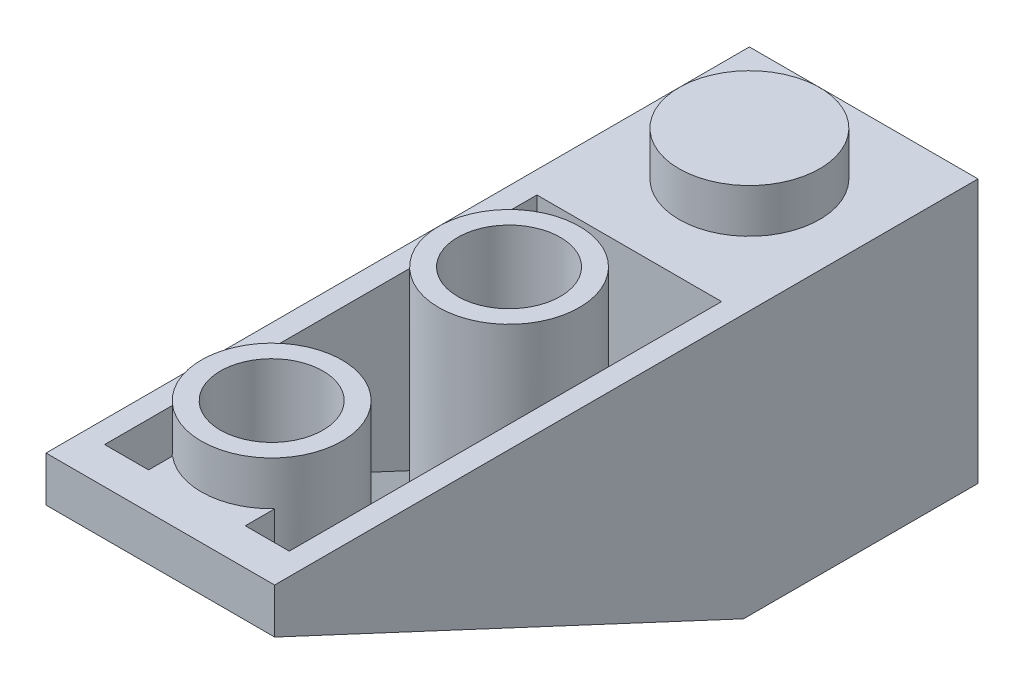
from build123d import *

# Parameters (mm, degrees)
BASE_EXTRUSION_DEPTH    = 7.8
BOSS_EXTRU_1_DEPTH      = 0.75
BOSS_EXTRU_2_DEPTH      = 0.75
ESQUISSE5_W             = 4.9
ESQUISSE5_H             = 5.1
ENL_V_MAT_EXTRU_1_DEPTH = 8
ESQUISSE6_R             = 2.4
BOSS_EXTRU_6_DEPTH      = 1.5
BOSS_EXTRU_7_REACH      = 29.333
ESQUISSE7_R             = 2.4
ESQUISSE7_R_2           = 1.75
ESQUISSE8_R             = 2.4
ENL_V_MAT_EXTRU_2_DEPTH = 1.5
BOSS_EXTRU_8_START      = -1.583169
ESQUISSE9_W             = 3.3
ESQUISSE9_H             = 1.840324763
BOSS_EXTRU_8_DEPTH      = 1.583169
BOSS_EXTRU_9_REACH      = 28.793
ESQUISSE10_W            = 6.3
ESQUISSE10_H            = 0.25


with BuildPart() as part:
    # Esquisse1 → Base-Extrusion (new body)
    with BuildSketch(Plane(origin=(0, 0, 0), x_dir=(0, 0, -1), z_dir=(1, 0, 0))):
        Polygon((-8, -9), (-24, -1.53907747), (-24, 0), (-23, 0), (-23, -1.005385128), (-8, -8), (-8, 0), (0, 0), (0, -9), align=None)
    extrude(amount=-BASE_EXTRUSION_DEPTH)

    # Esquisse2 → Boss.-Extru.1 (add)
    with BuildSketch(Plane(origin=(0, 0, 0), x_dir=(0, 0, -1), z_dir=(1, 0, 0))):
        Polygon((-24, -1.53907747), (-8, -9), (0, -9), (0, 0), (-24, 0), align=None)
    extrude(amount=-BOSS_EXTRU_1_DEPTH)

    # Esquisse3 → Boss.-Extru.2 (add)
    with BuildSketch(Plane.ZY.offset(7.8)):
        Polygon((24, -1.53907747), (8, -9), (0, -9), (0, 0), (24, 0), align=None)
    extrude(amount=-BOSS_EXTRU_2_DEPTH)

    # Esquisse5 → Enl_v. mat.-Extru.1 (cut)
    with BuildSketch(Plane.XZ.offset(9)):
        with Locations((-3.9, 4)):
            Rectangle(ESQUISSE5_W, ESQUISSE5_H)
    extrude(amount=-ENL_V_MAT_EXTRU_1_DEPTH, mode=Mode.SUBTRACT)

    # Esquisse6 → Boss.-Extru.6 (add)
    with BuildSketch(Plane(origin=(0, 0, 0), x_dir=(-1, 0, 0), z_dir=(0, 1, 0))):
        with Locations(Location((3.9, 3.9, 0), (0, 0, 90))):
            Circle(ESQUISSE6_R)
    extrude(amount=BOSS_EXTRU_6_DEPTH)

    # Boss.-Extru.7: up to this plane
    boss_extru_7_end = Plane(origin=(-7.8, -8, 8), z_dir=(0, 0.9063077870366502, -0.4226182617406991))
    # Esquisse7 → Boss.-Extru.7 (add, up to the surface)
    with BuildSketch(Plane(origin=(0, 1.5, 0), x_dir=(-1, 0, 0), z_dir=(0, 1, 0)), mode=Mode.PRIVATE) as boss_extru_7_sk1:
        with Locations(Location((3.9, 12.100625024, 0), (0, 0, 90))):
            Circle(ESQUISSE7_R)
        with Locations(Location((3.9, 12.100625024, 0), (0, 0, 90))):
            Circle(ESQUISSE7_R_2, mode=Mode.SUBTRACT)
    boss_extru_7_tool1 = split(extrude(boss_extru_7_sk1.sketch, amount=-BOSS_EXTRU_7_REACH, mode=Mode.PRIVATE), bisect_by=boss_extru_7_end, keep=Keep.BOTH, mode=Mode.PRIVATE)
    add(boss_extru_7_tool1.solids().sort_by_distance((-3.9, 1.5, 9.768507))[0])
    # Esquisse7 → Boss.-Extru.7 (add, up to the surface)
    with BuildSketch(Plane(origin=(0, 1.5, 0), x_dir=(-1, 0, 0), z_dir=(0, 1, 0)), mode=Mode.PRIVATE) as boss_extru_7_sk2:
        with Locations(Location((4, 20.1, 0), (0, 0, 90))):
            Circle(ESQUISSE7_R)
        with Locations(Location((4, 20.1, 0), (0, 0, 90))):
            Circle(ESQUISSE7_R_2, mode=Mode.SUBTRACT)
    boss_extru_7_tool2 = split(extrude(boss_extru_7_sk2.sketch, amount=-BOSS_EXTRU_7_REACH, mode=Mode.PRIVATE), bisect_by=boss_extru_7_end, keep=Keep.BOTH, mode=Mode.PRIVATE)
    add(boss_extru_7_tool2.solids().sort_by_distance((-4, 1.5, 17.767882))[0])

    # Esquisse8 → Enl_v. mat.-Extru.2 (cut)
    with BuildSketch(Plane.XZ.offset(9)):
        with Locations((-3.9, 12)):
            Circle(ESQUISSE8_R)
    extrude(amount=-ENL_V_MAT_EXTRU_2_DEPTH, mode=Mode.SUBTRACT)

    # Esquisse9 → Boss.-Extru.8 (add)
    with BuildSketch(Plane(origin=(0, 0, 0), x_dir=(-1, 0, 0), z_dir=(0, 1, 0)).offset(BOSS_EXTRU_8_START)):
        with Locations((3.9, 22.681100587)):
            Rectangle(ESQUISSE9_W, ESQUISSE9_H)
    extrude(amount=BOSS_EXTRU_8_DEPTH)

    # Boss.-Extru.9: up to this plane
    boss_extru_9_end = Plane(origin=(-7.8, -8, 8), z_dir=(0, 0.9063077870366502, -0.4226182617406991))
    # Esquisse10 → Boss.-Extru.9 (add, up to the surface)
    with BuildSketch(Plane(origin=(0, 0, 0), x_dir=(-1, 0, 0), z_dir=(0, 1, 0)), mode=Mode.PRIVATE) as boss_extru_9_sk1:
        with Locations((3.9, 22.875)):
            Rectangle(ESQUISSE10_W, ESQUISSE10_H)
    boss_extru_9_tool1 = split(extrude(boss_extru_9_sk1.sketch, amount=-BOSS_EXTRU_9_REACH, mode=Mode.PRIVATE), bisect_by=boss_extru_9_end, keep=Keep.BOTH, mode=Mode.PRIVATE)
    add(boss_extru_9_tool1.solids().sort_by_distance((-3.9, 0, 22.875))[0])


solid = part.part
